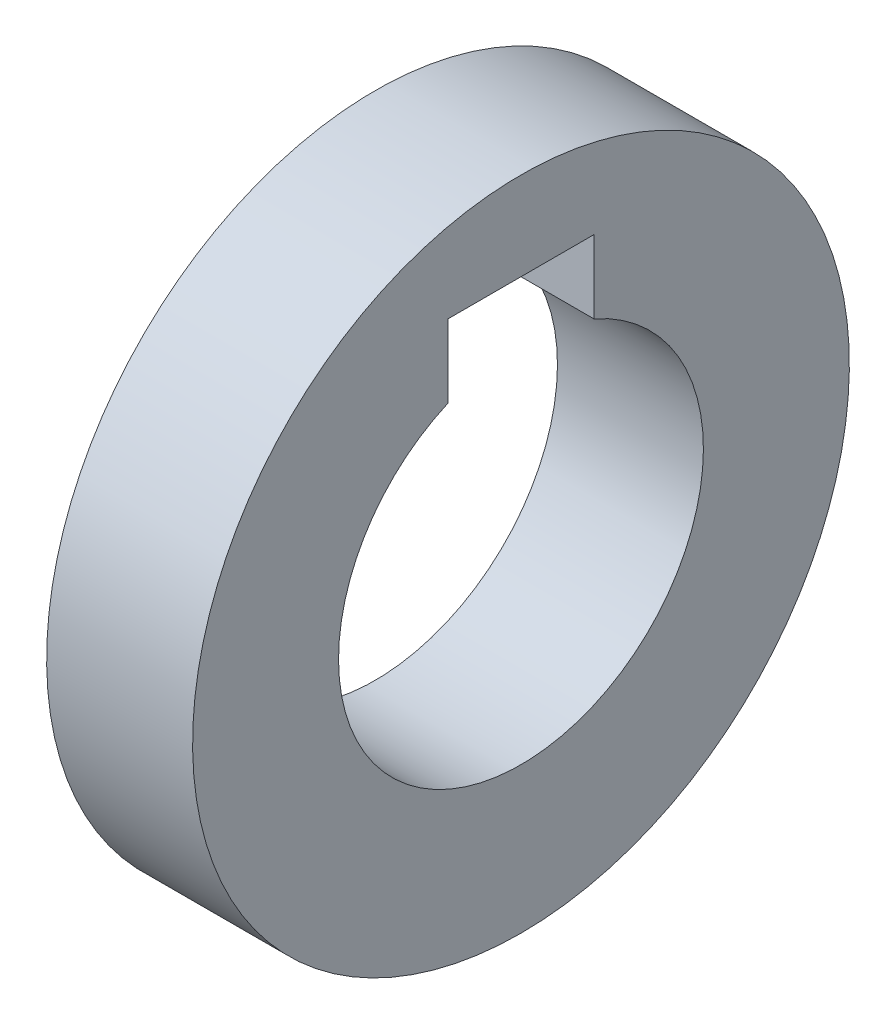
from build123d import *

# Parameters (mm, degrees)
SKETCH2_W          = 2
SKETCH2_H          = 2
SKETCH3_W          = 2
SKETCH3_H          = 1
CUT_EXTRUDE1_DEPTH = 2


with BuildPart() as part:
    # Sketch2 → Revolve1 (revolve)
    with BuildSketch(Plane.XY, mode=Mode.PRIVATE) as revolve1_sk:
        with Locations((0, 3.5)):
            Rectangle(SKETCH2_W, SKETCH2_H)
    revolve(revolve1_sk.sketch.rotate(Axis((-1, 0, 0), (1, 0, 0)), 180), axis=Axis((-1, 0, 0), (1, 0, 0)))

    # Sketch3 → Cut-Extrude1 (cut)
    with BuildSketch(Plane(origin=(1, 0, 0), x_dir=(0, 0, -1), z_dir=(1, 0, 0))):
        with Locations((0, 2.791287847)):
            Rectangle(SKETCH3_W, SKETCH3_H)
    extrude(amount=-CUT_EXTRUDE1_DEPTH, mode=Mode.SUBTRACT)


solid = part.part
